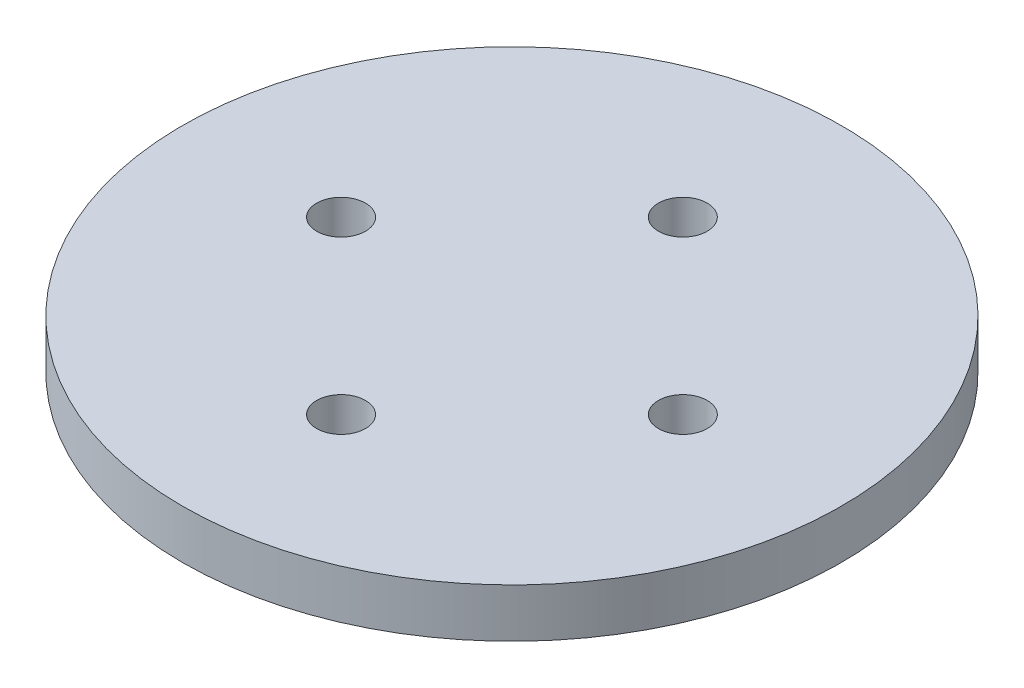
ISO-10303-21;
HEADER;
FILE_DESCRIPTION(('STEP AP214'),'2;1');
FILE_NAME('part.step','',(''),(''),'','','');
FILE_SCHEMA(('AUTOMOTIVE_DESIGN { 1 0 10303 214 1 1 1 1 }'));
ENDSEC;
DATA;
#1=APPLICATION_CONTEXT('core data for automotive mechanical design processes');
#2=APPLICATION_PROTOCOL_DEFINITION('international standard','automotive_design',2000,#1);
#3=PRODUCT_CONTEXT('',#1,'mechanical');
#4=PRODUCT('Part','Part','',(#3));
#5=PRODUCT_RELATED_PRODUCT_CATEGORY('part','',(#4));
#6=PRODUCT_DEFINITION_FORMATION('','',#4);
#7=PRODUCT_DEFINITION_CONTEXT('part definition',#1,'design');
#8=PRODUCT_DEFINITION('design','',#6,#7);
#9=PRODUCT_DEFINITION_SHAPE('','',#8);
#10=(LENGTH_UNIT() NAMED_UNIT(*) SI_UNIT(.MILLI.,.METRE.));
#11=(NAMED_UNIT(*) PLANE_ANGLE_UNIT() SI_UNIT($,.RADIAN.));
#12=(NAMED_UNIT(*) SI_UNIT($,.STERADIAN.) SOLID_ANGLE_UNIT());
#13=UNCERTAINTY_MEASURE_WITH_UNIT(LENGTH_MEASURE(1.E-05),#10,'distance_accuracy_value','');
#14=(GEOMETRIC_REPRESENTATION_CONTEXT(3) GLOBAL_UNCERTAINTY_ASSIGNED_CONTEXT((#13)) GLOBAL_UNIT_ASSIGNED_CONTEXT((#10,
#11,#12)) REPRESENTATION_CONTEXT('',''));
#15=CARTESIAN_POINT('',(0.,0.,0.));
#16=DIRECTION('',(0.,0.,1.));
#17=DIRECTION('',(1.,0.,0.));
#18=AXIS2_PLACEMENT_3D('',#15,#16,#17);
#19=CARTESIAN_POINT('',(-3.,0.,0.));
#20=DIRECTION('',(0.,-1.,0.));
#21=DIRECTION('',(0.,0.,-1.));
#22=AXIS2_PLACEMENT_3D('',#19,#20,#21);
#23=PLANE('',#22);
#24=CARTESIAN_POINT('',(0.,0.,0.));
#25=DIRECTION('',(0.,1.,0.));
#26=DIRECTION('',(0.,0.,1.));
#27=AXIS2_PLACEMENT_3D('',#24,#25,#26);
#28=CIRCLE('',#27,3.);
#29=CARTESIAN_POINT('',(0.,0.,3.));
#30=VERTEX_POINT('',#29);
#31=EDGE_CURVE('E10',#30,#30,#28,.T.);
#32=ORIENTED_EDGE('',*,*,#31,.F.);
#33=EDGE_LOOP('',(#32));
#34=FACE_BOUND('',#33,.T.);
#35=ADVANCED_FACE('F346',(#34),#23,.T.);
#36=CARTESIAN_POINT('',(0.,29.5546955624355,0.));
#37=DIRECTION('',(0.,1.,0.));
#38=DIRECTION('',(0.,0.,1.));
#39=AXIS2_PLACEMENT_3D('',#36,#37,#38);
#40=CYLINDRICAL_SURFACE('',#39,3.);
#41=ORIENTED_EDGE('',*,*,#31,.T.);
#42=EDGE_LOOP('',(#41));
#43=FACE_BOUND('',#42,.T.);
#44=CARTESIAN_POINT('',(0.,3.,0.));
#45=DIRECTION('',(0.,1.,0.));
#46=DIRECTION('',(0.,0.,1.));
#47=AXIS2_PLACEMENT_3D('',#44,#45,#46);
#48=CIRCLE('',#47,3.);
#49=CARTESIAN_POINT('',(0.,3.,3.));
#50=VERTEX_POINT('',#49);
#51=EDGE_CURVE('E352',#50,#50,#48,.T.);
#52=ORIENTED_EDGE('',*,*,#51,.F.);
#53=EDGE_LOOP('',(#52));
#54=FACE_BOUND('',#53,.T.);
#55=ADVANCED_FACE('F396',(#43,#54),#40,.T.);
#56=CARTESIAN_POINT('',(-13.5,3.,0.));
#57=DIRECTION('',(0.,-1.,0.));
#58=DIRECTION('',(0.,0.,-1.));
#59=AXIS2_PLACEMENT_3D('',#56,#57,#58);
#60=PLANE('',#59);
#61=CARTESIAN_POINT('',(0.,3.,-7.));
#62=DIRECTION('',(0.,-1.,0.));
#63=DIRECTION('',(-1.,0.,0.));
#64=AXIS2_PLACEMENT_3D('',#61,#62,#63);
#65=CIRCLE('',#64,1.);
#66=CARTESIAN_POINT('',(-0.999999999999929,3.,-7.00000000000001));
#67=VERTEX_POINT('',#66);
#68=EDGE_CURVE('E386',#67,#67,#65,.T.);
#69=ORIENTED_EDGE('',*,*,#68,.F.);
#70=EDGE_LOOP('',(#69));
#71=FACE_BOUND('',#70,.T.);
#72=CARTESIAN_POINT('',(-7.,3.,0.));
#73=DIRECTION('',(0.,-1.,0.));
#74=DIRECTION('',(0.,0.,1.));
#75=AXIS2_PLACEMENT_3D('',#72,#73,#74);
#76=CIRCLE('',#75,1.);
#77=CARTESIAN_POINT('',(-7.00000000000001,3.,0.999999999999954));
#78=VERTEX_POINT('',#77);
#79=EDGE_CURVE('E380',#78,#78,#76,.T.);
#80=ORIENTED_EDGE('',*,*,#79,.F.);
#81=EDGE_LOOP('',(#80));
#82=FACE_BOUND('',#81,.T.);
#83=CARTESIAN_POINT('',(0.,3.,7.));
#84=DIRECTION('',(0.,-1.,0.));
#85=DIRECTION('',(1.,0.,0.));
#86=AXIS2_PLACEMENT_3D('',#83,#84,#85);
#87=CIRCLE('',#86,1.);
#88=CARTESIAN_POINT('',(0.999999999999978,3.,7.));
#89=VERTEX_POINT('',#88);
#90=EDGE_CURVE('E374',#89,#89,#87,.T.);
#91=ORIENTED_EDGE('',*,*,#90,.F.);
#92=EDGE_LOOP('',(#91));
#93=FACE_BOUND('',#92,.T.);
#94=CARTESIAN_POINT('',(7.,3.,0.));
#95=DIRECTION('',(0.,-1.,0.));
#96=DIRECTION('',(0.,0.,-1.));
#97=AXIS2_PLACEMENT_3D('',#94,#95,#96);
#98=CIRCLE('',#97,1.);
#99=CARTESIAN_POINT('',(7.,3.,-1.));
#100=VERTEX_POINT('',#99);
#101=EDGE_CURVE('E368',#100,#100,#98,.T.);
#102=ORIENTED_EDGE('',*,*,#101,.F.);
#103=EDGE_LOOP('',(#102));
#104=FACE_BOUND('',#103,.T.);
#105=ORIENTED_EDGE('',*,*,#51,.T.);
#106=EDGE_LOOP('',(#105));
#107=FACE_BOUND('',#106,.T.);
#108=CARTESIAN_POINT('',(0.,3.,0.));
#109=DIRECTION('',(0.,1.,0.));
#110=DIRECTION('',(0.,0.,1.));
#111=AXIS2_PLACEMENT_3D('',#108,#109,#110);
#112=CIRCLE('',#111,13.5);
#113=CARTESIAN_POINT('',(0.,3.,13.5));
#114=VERTEX_POINT('',#113);
#115=EDGE_CURVE('E356',#114,#114,#112,.T.);
#116=ORIENTED_EDGE('',*,*,#115,.F.);
#117=EDGE_LOOP('',(#116));
#118=FACE_BOUND('',#117,.T.);
#119=ADVANCED_FACE('F392',(#71,#82,#93,#104,#107,#118),#60,.T.);
#120=CARTESIAN_POINT('',(0.,29.5546955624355,0.));
#121=DIRECTION('',(0.,1.,0.));
#122=DIRECTION('',(0.,0.,1.));
#123=AXIS2_PLACEMENT_3D('',#120,#121,#122);
#124=CYLINDRICAL_SURFACE('',#123,13.5);
#125=ORIENTED_EDGE('',*,*,#115,.T.);
#126=EDGE_LOOP('',(#125));
#127=FACE_BOUND('',#126,.T.);
#128=CARTESIAN_POINT('',(0.,5.,0.));
#129=DIRECTION('',(0.,1.,0.));
#130=DIRECTION('',(0.,0.,1.));
#131=AXIS2_PLACEMENT_3D('',#128,#129,#130);
#132=CIRCLE('',#131,13.5);
#133=CARTESIAN_POINT('',(0.,5.,13.5));
#134=VERTEX_POINT('',#133);
#135=EDGE_CURVE('E360',#134,#134,#132,.T.);
#136=ORIENTED_EDGE('',*,*,#135,.F.);
#137=EDGE_LOOP('',(#136));
#138=FACE_BOUND('',#137,.T.);
#139=ADVANCED_FACE('F395',(#127,#138),#124,.T.);
#140=CARTESIAN_POINT('',(0.,5.,0.));
#141=DIRECTION('',(0.,1.,0.));
#142=DIRECTION('',(0.,0.,1.));
#143=AXIS2_PLACEMENT_3D('',#140,#141,#142);
#144=PLANE('',#143);
#145=CARTESIAN_POINT('',(0.,5.,-7.));
#146=DIRECTION('',(0.,-1.,0.));
#147=DIRECTION('',(-1.,0.,0.));
#148=AXIS2_PLACEMENT_3D('',#145,#146,#147);
#149=CIRCLE('',#148,1.);
#150=CARTESIAN_POINT('',(-0.999999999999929,5.,-7.00000000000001));
#151=VERTEX_POINT('',#150);
#152=EDGE_CURVE('E383',#151,#151,#149,.T.);
#153=ORIENTED_EDGE('',*,*,#152,.T.);
#154=EDGE_LOOP('',(#153));
#155=FACE_BOUND('',#154,.T.);
#156=CARTESIAN_POINT('',(-7.,5.,0.));
#157=DIRECTION('',(0.,-1.,0.));
#158=DIRECTION('',(0.,0.,1.));
#159=AXIS2_PLACEMENT_3D('',#156,#157,#158);
#160=CIRCLE('',#159,1.);
#161=CARTESIAN_POINT('',(-7.00000000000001,5.,0.999999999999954));
#162=VERTEX_POINT('',#161);
#163=EDGE_CURVE('E377',#162,#162,#160,.T.);
#164=ORIENTED_EDGE('',*,*,#163,.T.);
#165=EDGE_LOOP('',(#164));
#166=FACE_BOUND('',#165,.T.);
#167=CARTESIAN_POINT('',(0.,5.,7.));
#168=DIRECTION('',(0.,-1.,0.));
#169=DIRECTION('',(1.,0.,0.));
#170=AXIS2_PLACEMENT_3D('',#167,#168,#169);
#171=CIRCLE('',#170,1.);
#172=CARTESIAN_POINT('',(0.999999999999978,5.,7.));
#173=VERTEX_POINT('',#172);
#174=EDGE_CURVE('E371',#173,#173,#171,.T.);
#175=ORIENTED_EDGE('',*,*,#174,.T.);
#176=EDGE_LOOP('',(#175));
#177=FACE_BOUND('',#176,.T.);
#178=CARTESIAN_POINT('',(7.,5.,0.));
#179=DIRECTION('',(0.,-1.,0.));
#180=DIRECTION('',(0.,0.,-1.));
#181=AXIS2_PLACEMENT_3D('',#178,#179,#180);
#182=CIRCLE('',#181,1.);
#183=CARTESIAN_POINT('',(7.,5.,-1.));
#184=VERTEX_POINT('',#183);
#185=EDGE_CURVE('E365',#184,#184,#182,.T.);
#186=ORIENTED_EDGE('',*,*,#185,.T.);
#187=EDGE_LOOP('',(#186));
#188=FACE_BOUND('',#187,.T.);
#189=ORIENTED_EDGE('',*,*,#135,.T.);
#190=EDGE_LOOP('',(#189));
#191=FACE_BOUND('',#190,.T.);
#192=ADVANCED_FACE('F408',(#155,#166,#177,#188,#191),#144,.T.);
#193=CARTESIAN_POINT('',(7.,5.,0.));
#194=DIRECTION('',(0.,-1.,0.));
#195=DIRECTION('',(0.,0.,-1.));
#196=AXIS2_PLACEMENT_3D('',#193,#194,#195);
#197=CYLINDRICAL_SURFACE('',#196,1.);
#198=ORIENTED_EDGE('',*,*,#185,.F.);
#199=EDGE_LOOP('',(#198));
#200=FACE_BOUND('',#199,.T.);
#201=ORIENTED_EDGE('',*,*,#101,.T.);
#202=EDGE_LOOP('',(#201));
#203=FACE_BOUND('',#202,.T.);
#204=ADVANCED_FACE('F413',(#200,#203),#197,.F.);
#205=CARTESIAN_POINT('',(0.,5.,7.));
#206=DIRECTION('',(0.,-1.,0.));
#207=DIRECTION('',(0.,0.,-1.));
#208=AXIS2_PLACEMENT_3D('',#205,#206,#207);
#209=CYLINDRICAL_SURFACE('',#208,1.);
#210=ORIENTED_EDGE('',*,*,#174,.F.);
#211=EDGE_LOOP('',(#210));
#212=FACE_BOUND('',#211,.T.);
#213=ORIENTED_EDGE('',*,*,#90,.T.);
#214=EDGE_LOOP('',(#213));
#215=FACE_BOUND('',#214,.T.);
#216=ADVANCED_FACE('F419',(#212,#215),#209,.F.);
#217=CARTESIAN_POINT('',(-7.,5.,0.));
#218=DIRECTION('',(0.,-1.,0.));
#219=DIRECTION('',(0.,0.,-1.));
#220=AXIS2_PLACEMENT_3D('',#217,#218,#219);
#221=CYLINDRICAL_SURFACE('',#220,1.);
#222=ORIENTED_EDGE('',*,*,#163,.F.);
#223=EDGE_LOOP('',(#222));
#224=FACE_BOUND('',#223,.T.);
#225=ORIENTED_EDGE('',*,*,#79,.T.);
#226=EDGE_LOOP('',(#225));
#227=FACE_BOUND('',#226,.T.);
#228=ADVANCED_FACE('F452',(#224,#227),#221,.F.);
#229=CARTESIAN_POINT('',(0.,5.,-7.));
#230=DIRECTION('',(0.,-1.,0.));
#231=DIRECTION('',(0.,0.,-1.));
#232=AXIS2_PLACEMENT_3D('',#229,#230,#231);
#233=CYLINDRICAL_SURFACE('',#232,1.);
#234=ORIENTED_EDGE('',*,*,#152,.F.);
#235=EDGE_LOOP('',(#234));
#236=FACE_BOUND('',#235,.T.);
#237=ORIENTED_EDGE('',*,*,#68,.T.);
#238=EDGE_LOOP('',(#237));
#239=FACE_BOUND('',#238,.T.);
#240=ADVANCED_FACE('F390',(#236,#239),#233,.F.);
#241=CLOSED_SHELL('',(#35,#55,#119,#139,#192,#204,#216,#228,#240));
#242=MANIFOLD_SOLID_BREP('B2',#241);
#243=ADVANCED_BREP_SHAPE_REPRESENTATION('',(#18,#242),#14);
#244=SHAPE_DEFINITION_REPRESENTATION(#9,#243);
ENDSEC;
END-ISO-10303-21;
